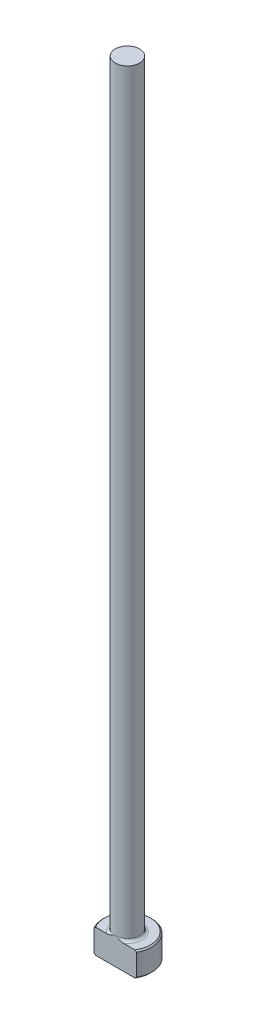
ISO-10303-21;
HEADER;
FILE_DESCRIPTION(('STEP AP214'),'2;1');
FILE_NAME('part.step','',(''),(''),'','','');
FILE_SCHEMA(('AUTOMOTIVE_DESIGN { 1 0 10303 214 1 1 1 1 }'));
ENDSEC;
DATA;
#1=APPLICATION_CONTEXT('core data for automotive mechanical design processes');
#2=APPLICATION_PROTOCOL_DEFINITION('international standard','automotive_design',2000,#1);
#3=PRODUCT_CONTEXT('',#1,'mechanical');
#4=PRODUCT('Part','Part','',(#3));
#5=PRODUCT_RELATED_PRODUCT_CATEGORY('part','',(#4));
#6=PRODUCT_DEFINITION_FORMATION('','',#4);
#7=PRODUCT_DEFINITION_CONTEXT('part definition',#1,'design');
#8=PRODUCT_DEFINITION('design','',#6,#7);
#9=PRODUCT_DEFINITION_SHAPE('','',#8);
#10=(LENGTH_UNIT() NAMED_UNIT(*) SI_UNIT(.MILLI.,.METRE.));
#11=(NAMED_UNIT(*) PLANE_ANGLE_UNIT() SI_UNIT($,.RADIAN.));
#12=(NAMED_UNIT(*) SI_UNIT($,.STERADIAN.) SOLID_ANGLE_UNIT());
#13=UNCERTAINTY_MEASURE_WITH_UNIT(LENGTH_MEASURE(1.E-05),#10,'distance_accuracy_value','');
#14=(GEOMETRIC_REPRESENTATION_CONTEXT(3) GLOBAL_UNCERTAINTY_ASSIGNED_CONTEXT((#13)) GLOBAL_UNIT_ASSIGNED_CONTEXT((#10,
#11,#12)) REPRESENTATION_CONTEXT('',''));
#15=CARTESIAN_POINT('',(0.,0.,0.));
#16=DIRECTION('',(0.,0.,1.));
#17=DIRECTION('',(1.,0.,0.));
#18=AXIS2_PLACEMENT_3D('',#15,#16,#17);
#19=CARTESIAN_POINT('',(0.,0.,0.));
#20=DIRECTION('',(0.,-1.,0.));
#21=DIRECTION('',(0.,0.,-1.));
#22=AXIS2_PLACEMENT_3D('',#19,#20,#21);
#23=PLANE('',#22);
#24=DIRECTION('',(1.,0.,0.));
#25=VECTOR('',#24,1.);
#26=CARTESIAN_POINT('',(-4.12444598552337,0.,2.38124999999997));
#27=LINE('',#26,#25);
#28=CARTESIAN_POINT('',(-3.82834437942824,0.,2.38124999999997));
#29=VERTEX_POINT('',#28);
#30=CARTESIAN_POINT('',(3.82834437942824,0.,2.38124999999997));
#31=VERTEX_POINT('',#30);
#32=EDGE_CURVE('E92',#29,#31,#27,.T.);
#33=ORIENTED_EDGE('',*,*,#32,.F.);
#34=CARTESIAN_POINT('',(0.,0.,0.));
#35=DIRECTION('',(0.,-1.,0.));
#36=DIRECTION('',(0.,0.,-1.));
#37=AXIS2_PLACEMENT_3D('',#34,#35,#36);
#38=CIRCLE('',#37,4.50849999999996);
#39=EDGE_CURVE('E105',#29,#31,#38,.T.);
#40=ORIENTED_EDGE('',*,*,#39,.T.);
#41=EDGE_LOOP('',(#33,#40));
#42=FACE_BOUND('',#41,.T.);
#43=ADVANCED_FACE('F37',(#42),#23,.T.);
#44=CARTESIAN_POINT('',(0.,259.958771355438,0.));
#45=DIRECTION('',(0.,1.,0.));
#46=DIRECTION('',(0.,0.,1.));
#47=AXIS2_PLACEMENT_3D('',#44,#45,#46);
#48=CYLINDRICAL_SURFACE('',#47,4.76249999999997);
#49=DIRECTION('',(0.,-1.,0.));
#50=VECTOR('',#49,1.);
#51=CARTESIAN_POINT('',(-4.12444598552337,152.4,2.38124999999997));
#52=LINE('',#51,#50);
#53=CARTESIAN_POINT('',(-4.12444598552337,4.49579999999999,2.38124999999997));
#54=VERTEX_POINT('',#53);
#55=CARTESIAN_POINT('',(-4.12444598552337,0.254000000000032,2.38124999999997));
#56=VERTEX_POINT('',#55);
#57=EDGE_CURVE('E95',#54,#56,#52,.T.);
#58=ORIENTED_EDGE('',*,*,#57,.F.);
#59=CARTESIAN_POINT('',(0.,4.49579999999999,0.));
#60=DIRECTION('',(0.,1.,0.));
#61=DIRECTION('',(0.,0.,1.));
#62=AXIS2_PLACEMENT_3D('',#59,#60,#61);
#63=CIRCLE('',#62,4.76249999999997);
#64=CARTESIAN_POINT('',(4.12444598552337,4.49579999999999,2.38124999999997));
#65=VERTEX_POINT('',#64);
#66=EDGE_CURVE('E109',#54,#65,#63,.F.);
#67=ORIENTED_EDGE('',*,*,#66,.T.);
#68=DIRECTION('',(0.,-1.,0.));
#69=VECTOR('',#68,1.);
#70=CARTESIAN_POINT('',(4.12444598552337,152.4,2.38124999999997));
#71=LINE('',#70,#69);
#72=CARTESIAN_POINT('',(4.12444598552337,0.254000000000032,2.38124999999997));
#73=VERTEX_POINT('',#72);
#74=EDGE_CURVE('E187',#65,#73,#71,.T.);
#75=ORIENTED_EDGE('',*,*,#74,.T.);
#76=CARTESIAN_POINT('',(0.,0.254000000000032,0.));
#77=DIRECTION('',(0.,-1.,0.));
#78=DIRECTION('',(0.,0.,-1.));
#79=AXIS2_PLACEMENT_3D('',#76,#77,#78);
#80=CIRCLE('',#79,4.76249999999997);
#81=EDGE_CURVE('E115',#73,#56,#80,.F.);
#82=ORIENTED_EDGE('',*,*,#81,.T.);
#83=EDGE_LOOP('',(#58,#67,#75,#82));
#84=FACE_BOUND('',#83,.T.);
#85=ADVANCED_FACE('F160',(#84),#48,.T.);
#86=CARTESIAN_POINT('',(-4.76249999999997,4.7498,0.));
#87=DIRECTION('',(0.,1.,0.));
#88=DIRECTION('',(0.,0.,1.));
#89=AXIS2_PLACEMENT_3D('',#86,#87,#88);
#90=PLANE('',#89);
#91=DIRECTION('',(-1.,0.,0.));
#92=VECTOR('',#91,1.);
#93=CARTESIAN_POINT('',(-4.76249999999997,4.7498,2.38124999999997));
#94=LINE('',#93,#92);
#95=CARTESIAN_POINT('',(3.82834437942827,4.7498,2.38124999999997));
#96=VERTEX_POINT('',#95);
#97=CARTESIAN_POINT('',(1.63628053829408,4.7498,2.38124999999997));
#98=VERTEX_POINT('',#97);
#99=EDGE_CURVE('E58',#96,#98,#94,.T.);
#100=ORIENTED_EDGE('',*,*,#99,.F.);
#101=CARTESIAN_POINT('',(0.,4.7498,0.));
#102=DIRECTION('',(0.,1.,0.));
#103=DIRECTION('',(0.,0.,1.));
#104=AXIS2_PLACEMENT_3D('',#101,#102,#103);
#105=CIRCLE('',#104,4.50849999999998);
#106=CARTESIAN_POINT('',(-3.82834437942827,4.7498,2.38124999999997));
#107=VERTEX_POINT('',#106);
#108=EDGE_CURVE('E182',#96,#107,#105,.T.);
#109=ORIENTED_EDGE('',*,*,#108,.T.);
#110=CARTESIAN_POINT('',(-1.63628053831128,4.74979999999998,2.38124999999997));
#111=VERTEX_POINT('',#110);
#112=EDGE_CURVE('E140',#111,#107,#94,.T.);
#113=ORIENTED_EDGE('',*,*,#112,.F.);
#114=CARTESIAN_POINT('',(0.,4.7498,0.));
#115=DIRECTION('',(0.,1.,0.));
#116=DIRECTION('',(0.,0.,1.));
#117=AXIS2_PLACEMENT_3D('',#114,#115,#116);
#118=CIRCLE('',#117,2.88924999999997);
#119=EDGE_CURVE('E112',#111,#98,#118,.F.);
#120=ORIENTED_EDGE('',*,*,#119,.T.);
#121=EDGE_LOOP('',(#100,#109,#113,#120));
#122=FACE_BOUND('',#121,.T.);
#123=ADVANCED_FACE('F164',(#122),#90,.T.);
#124=CARTESIAN_POINT('',(0.,259.958771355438,0.));
#125=DIRECTION('',(0.,1.,0.));
#126=DIRECTION('',(0.,0.,1.));
#127=AXIS2_PLACEMENT_3D('',#124,#125,#126);
#128=CYLINDRICAL_SURFACE('',#127,2.38124999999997);
#129=CARTESIAN_POINT('',(0.,5.25779999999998,0.));
#130=DIRECTION('',(0.,1.,0.));
#131=DIRECTION('',(0.,0.,1.));
#132=AXIS2_PLACEMENT_3D('',#129,#130,#131);
#133=CIRCLE('',#132,2.38124999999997);
#134=CARTESIAN_POINT('',(0.,5.25779999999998,2.38124999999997));
#135=VERTEX_POINT('',#134);
#136=EDGE_CURVE('E108',#135,#135,#133,.T.);
#137=ORIENTED_EDGE('',*,*,#136,.T.);
#138=EDGE_LOOP('',(#137));
#139=FACE_BOUND('',#138,.T.);
#140=CARTESIAN_POINT('',(0.,152.4,0.));
#141=DIRECTION('',(0.,1.,0.));
#142=DIRECTION('',(0.,0.,1.));
#143=AXIS2_PLACEMENT_3D('',#140,#141,#142);
#144=CIRCLE('',#143,2.38124999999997);
#145=CARTESIAN_POINT('',(0.,152.4,2.38124999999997));
#146=VERTEX_POINT('',#145);
#147=EDGE_CURVE('E100',#146,#146,#144,.T.);
#148=ORIENTED_EDGE('',*,*,#147,.F.);
#149=EDGE_LOOP('',(#148));
#150=FACE_BOUND('',#149,.T.);
#151=ADVANCED_FACE('F169',(#139,#150),#128,.T.);
#152=CARTESIAN_POINT('',(-2.38124999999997,152.4,0.));
#153=DIRECTION('',(0.,1.,0.));
#154=DIRECTION('',(0.,0.,1.));
#155=AXIS2_PLACEMENT_3D('',#152,#153,#154);
#156=PLANE('',#155);
#157=ORIENTED_EDGE('',*,*,#147,.T.);
#158=EDGE_LOOP('',(#157));
#159=FACE_BOUND('',#158,.T.);
#160=ADVANCED_FACE('F127',(#159),#156,.T.);
#161=CARTESIAN_POINT('',(0.,4.74980000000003,0.));
#162=DIRECTION('',(0.,-1.,0.));
#163=DIRECTION('',(0.,0.,-1.));
#164=AXIS2_PLACEMENT_3D('',#161,#162,#163);
#165=CONICAL_SURFACE('',#164,4.50849999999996,0.785398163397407);
#166=CARTESIAN_POINT('',(4.12514598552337,4.49519376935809,2.38124999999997));
#167=CARTESIAN_POINT('',(4.00297518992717,4.60095936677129,2.38124999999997));
#168=CARTESIAN_POINT('',(3.88025631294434,4.7061050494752,2.38124999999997));
#169=CARTESIAN_POINT('',(3.63329815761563,4.9147146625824,2.38124999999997));
#170=CARTESIAN_POINT('',(3.50905817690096,5.01817776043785,2.38124999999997));
#171=CARTESIAN_POINT('',(3.2558160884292,5.22527725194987,2.38124999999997));
#172=CARTESIAN_POINT('',(3.12677062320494,5.32886083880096,2.38124999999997));
#173=CARTESIAN_POINT('',(2.86622698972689,5.53284356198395,2.38124999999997));
#174=CARTESIAN_POINT('',(2.7347294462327,5.63324349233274,2.38124999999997));
#175=CARTESIAN_POINT('',(2.46828886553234,5.82978962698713,2.38124999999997));
#176=CARTESIAN_POINT('',(2.33334128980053,5.92592971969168,2.38124999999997));
#177=CARTESIAN_POINT('',(2.0589776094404,6.11194575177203,2.38124999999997));
#178=CARTESIAN_POINT('',(1.91955795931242,6.20181653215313,2.38124999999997));
#179=CARTESIAN_POINT('',(1.63609152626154,6.37137961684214,2.38124999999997));
#180=CARTESIAN_POINT('',(1.49209041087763,6.45114724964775,2.38124999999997));
#181=CARTESIAN_POINT('',(1.19698803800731,6.59621615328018,2.38124999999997));
#182=CARTESIAN_POINT('',(1.04590060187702,6.66154427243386,2.38124999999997));
#183=CARTESIAN_POINT('',(0.811614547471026,6.7436275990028,2.38124999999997));
#184=CARTESIAN_POINT('',(0.731281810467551,6.76852601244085,2.38124999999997));
#185=CARTESIAN_POINT('',(0.568750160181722,6.81132512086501,2.38124999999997));
#186=CARTESIAN_POINT('',(0.486551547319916,6.82922693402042,2.38124999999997));
#187=CARTESIAN_POINT('',(0.321272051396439,6.85684671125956,2.38124999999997));
#188=CARTESIAN_POINT('',(0.238199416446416,6.86661311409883,2.38124999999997));
#189=CARTESIAN_POINT('',(0.0714834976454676,6.87742889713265,2.38124999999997));
#190=CARTESIAN_POINT('',(-0.0121597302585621,6.8784791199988,2.38124999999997));
#191=CARTESIAN_POINT('',(-0.179163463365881,6.8717794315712,2.38124999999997));
#192=CARTESIAN_POINT('',(-0.262523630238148,6.86402127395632,2.38124999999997));
#193=CARTESIAN_POINT('',(-0.428053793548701,6.84027123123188,2.38124999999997));
#194=CARTESIAN_POINT('',(-0.510223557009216,6.82427775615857,2.38124999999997));
#195=CARTESIAN_POINT('',(-0.673363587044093,6.78495183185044,2.38124999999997));
#196=CARTESIAN_POINT('',(-0.754321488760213,6.76156896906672,2.38124999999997));
#197=CARTESIAN_POINT('',(-0.914191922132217,6.70871125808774,2.38124999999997));
#198=CARTESIAN_POINT('',(-0.993104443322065,6.67923637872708,2.38124999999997));
#199=CARTESIAN_POINT('',(-1.16723389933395,6.60781445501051,2.38124999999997));
#200=CARTESIAN_POINT('',(-1.26191225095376,6.56456501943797,2.38124999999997));
#201=CARTESIAN_POINT('',(-1.44844363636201,6.47230549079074,2.38124999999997));
#202=CARTESIAN_POINT('',(-1.54029498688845,6.4232920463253,2.38124999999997));
#203=CARTESIAN_POINT('',(-1.72169646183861,6.32078732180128,2.38124999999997));
#204=CARTESIAN_POINT('',(-1.81124138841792,6.26728691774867,2.38124999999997));
#205=CARTESIAN_POINT('',(-1.98819821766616,6.15692869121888,2.38124999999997));
#206=CARTESIAN_POINT('',(-2.07561054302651,6.10007154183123,2.38124999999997));
#207=CARTESIAN_POINT('',(-2.24912105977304,5.9834335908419,2.38124999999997));
#208=CARTESIAN_POINT('',(-2.33520994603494,5.92363901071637,2.38124999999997));
#209=CARTESIAN_POINT('',(-2.50589894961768,5.80195652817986,2.38124999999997));
#210=CARTESIAN_POINT('',(-2.59049895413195,5.74006846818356,2.38124999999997));
#211=CARTESIAN_POINT('',(-2.84223660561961,5.55206990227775,2.38124999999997));
#212=CARTESIAN_POINT('',(-3.00752130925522,5.42348112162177,2.38124999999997));
#213=CARTESIAN_POINT('',(-3.33377354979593,5.16258132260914,2.38124999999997));
#214=CARTESIAN_POINT('',(-3.49475818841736,5.03029147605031,2.38124999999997));
#215=CARTESIAN_POINT('',(-3.73348531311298,4.83027359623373,2.38124999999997));
#216=CARTESIAN_POINT('',(-3.81219356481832,4.76369334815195,2.38124999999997));
#217=CARTESIAN_POINT('',(-3.96906071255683,4.62989594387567,2.38124999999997));
#218=CARTESIAN_POINT('',(-4.04721963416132,4.56267881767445,2.38124999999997));
#219=CARTESIAN_POINT('',(-4.12514598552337,4.49519376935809,2.38124999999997));
#220=B_SPLINE_CURVE_WITH_KNOTS('',3,(#166,#167,#168,#169,#170,#171,#172,#173,#174,#175,#176,
#177,#178,#179,#180,#181,#182,#183,#184,#185,#186,#187,#188,#189,#190,#191,#192,#193,#194,#195,
#196,#197,#198,#199,#200,#201,#202,#203,#204,#205,#206,#207,#208,#209,#210,#211,#212,#213,#214,
#215,#216,#217,#218,#219),.UNSPECIFIED.,.F.,.F.,(4,2,2,2,2,2,2,2,2,2,2,2,2,2,2,2,2,2,2,2,2,2,2,
2,2,2,4),(0.,0.484787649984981,0.969808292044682,1.46620017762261,1.96246727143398,
2.45942471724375,2.95678639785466,3.45018895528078,3.94266623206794,4.19472143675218,
4.44673634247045,4.69723978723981,4.94771901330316,5.19843292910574,5.4491952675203,
5.70170675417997,5.95421953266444,6.26622041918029,6.57840361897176,6.89123777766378,
7.20400941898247,7.51842263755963,7.83285957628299,8.46097181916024,9.08602581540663,
9.39529830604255,9.70455630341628),.UNSPECIFIED.);
#221=EDGE_CURVE('E63',#65,#96,#220,.T.);
#222=ORIENTED_EDGE('',*,*,#221,.F.);
#223=ORIENTED_EDGE('',*,*,#66,.F.);
#224=EDGE_CURVE('E133',#107,#54,#220,.T.);
#225=ORIENTED_EDGE('',*,*,#224,.F.);
#226=ORIENTED_EDGE('',*,*,#108,.F.);
#227=EDGE_LOOP('',(#222,#223,#225,#226));
#228=FACE_BOUND('',#227,.T.);
#229=ADVANCED_FACE('F147',(#228),#165,.T.);
#230=CARTESIAN_POINT('',(0.,0.254000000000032,0.));
#231=DIRECTION('',(0.,1.,0.));
#232=DIRECTION('',(0.,0.,1.));
#233=AXIS2_PLACEMENT_3D('',#230,#231,#232);
#234=CONICAL_SURFACE('',#233,4.76249999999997,0.785398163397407);
#235=CARTESIAN_POINT('',(-4.12514598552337,0.254606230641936,2.38124999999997));
#236=CARTESIAN_POINT('',(-4.00297518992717,0.148840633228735,2.38124999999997));
#237=CARTESIAN_POINT('',(-3.88025631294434,0.0436949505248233,2.38124999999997));
#238=CARTESIAN_POINT('',(-3.63329815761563,-0.164914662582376,2.38124999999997));
#239=CARTESIAN_POINT('',(-3.50905817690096,-0.268377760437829,2.38124999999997));
#240=CARTESIAN_POINT('',(-3.2558160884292,-0.475477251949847,2.38124999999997));
#241=CARTESIAN_POINT('',(-3.12677062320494,-0.579060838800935,2.38124999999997));
#242=CARTESIAN_POINT('',(-2.86622698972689,-0.783043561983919,2.38124999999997));
#243=CARTESIAN_POINT('',(-2.7347294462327,-0.88344349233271,2.38124999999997));
#244=CARTESIAN_POINT('',(-2.46828886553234,-1.0799896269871,2.38124999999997));
#245=CARTESIAN_POINT('',(-2.33334128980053,-1.17612971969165,2.38124999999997));
#246=CARTESIAN_POINT('',(-2.0589776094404,-1.362145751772,2.38124999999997));
#247=CARTESIAN_POINT('',(-1.91955795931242,-1.4520165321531,2.38124999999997));
#248=CARTESIAN_POINT('',(-1.63609152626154,-1.62157961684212,2.38124999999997));
#249=CARTESIAN_POINT('',(-1.49209041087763,-1.70134724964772,2.38124999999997));
#250=CARTESIAN_POINT('',(-1.1969880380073,-1.84641615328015,2.38124999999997));
#251=CARTESIAN_POINT('',(-1.04590060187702,-1.91174427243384,2.38124999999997));
#252=CARTESIAN_POINT('',(-0.811614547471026,-1.99382759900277,2.38124999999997));
#253=CARTESIAN_POINT('',(-0.731281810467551,-2.01872601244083,2.38124999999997));
#254=CARTESIAN_POINT('',(-0.568750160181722,-2.06152512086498,2.38124999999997));
#255=CARTESIAN_POINT('',(-0.486551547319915,-2.0794269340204,2.38124999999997));
#256=CARTESIAN_POINT('',(-0.321272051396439,-2.10704671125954,2.38124999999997));
#257=CARTESIAN_POINT('',(-0.238199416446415,-2.11681311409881,2.38124999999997));
#258=CARTESIAN_POINT('',(-0.0714834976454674,-2.12762889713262,2.38124999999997));
#259=CARTESIAN_POINT('',(0.012159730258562,-2.12867911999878,2.38124999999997));
#260=CARTESIAN_POINT('',(0.17916346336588,-2.12197943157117,2.38124999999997));
#261=CARTESIAN_POINT('',(0.262523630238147,-2.1142212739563,2.38124999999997));
#262=CARTESIAN_POINT('',(0.4280537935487,-2.09047123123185,2.38124999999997));
#263=CARTESIAN_POINT('',(0.510223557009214,-2.07447775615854,2.38124999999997));
#264=CARTESIAN_POINT('',(0.673363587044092,-2.03515183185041,2.38124999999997));
#265=CARTESIAN_POINT('',(0.754321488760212,-2.01176896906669,2.38124999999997));
#266=CARTESIAN_POINT('',(0.914191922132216,-1.95891125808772,2.38124999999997));
#267=CARTESIAN_POINT('',(0.993104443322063,-1.92943637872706,2.38124999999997));
#268=CARTESIAN_POINT('',(1.16723389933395,-1.85801445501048,2.38124999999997));
#269=CARTESIAN_POINT('',(1.26191225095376,-1.81476501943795,2.38124999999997));
#270=CARTESIAN_POINT('',(1.44844363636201,-1.72250549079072,2.38124999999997));
#271=CARTESIAN_POINT('',(1.54029498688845,-1.67349204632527,2.38124999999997));
#272=CARTESIAN_POINT('',(1.72169646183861,-1.57098732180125,2.38124999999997));
#273=CARTESIAN_POINT('',(1.81124138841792,-1.51748691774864,2.38124999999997));
#274=CARTESIAN_POINT('',(1.98819821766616,-1.40712869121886,2.38124999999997));
#275=CARTESIAN_POINT('',(2.0756105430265,-1.3502715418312,2.38124999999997));
#276=CARTESIAN_POINT('',(2.24912105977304,-1.23363359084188,2.38124999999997));
#277=CARTESIAN_POINT('',(2.33520994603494,-1.17383901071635,2.38124999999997));
#278=CARTESIAN_POINT('',(2.50589894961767,-1.05215652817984,2.38124999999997));
#279=CARTESIAN_POINT('',(2.59049895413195,-0.990268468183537,2.38124999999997));
#280=CARTESIAN_POINT('',(2.84223660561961,-0.80226990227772,2.38124999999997));
#281=CARTESIAN_POINT('',(3.00752130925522,-0.673681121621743,2.38124999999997));
#282=CARTESIAN_POINT('',(3.33377354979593,-0.412781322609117,2.38124999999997));
#283=CARTESIAN_POINT('',(3.49475818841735,-0.280491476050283,2.38124999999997));
#284=CARTESIAN_POINT('',(3.73348531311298,-0.0804735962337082,2.38124999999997));
#285=CARTESIAN_POINT('',(3.81219356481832,-0.0138933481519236,2.38124999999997));
#286=CARTESIAN_POINT('',(3.96906071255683,0.119904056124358,2.38124999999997));
#287=CARTESIAN_POINT('',(4.04721963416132,0.187121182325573,2.38124999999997));
#288=CARTESIAN_POINT('',(4.12514598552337,0.254606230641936,2.38124999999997));
#289=B_SPLINE_CURVE_WITH_KNOTS('',3,(#235,#236,#237,#238,#239,#240,#241,#242,#243,#244,#245,
#246,#247,#248,#249,#250,#251,#252,#253,#254,#255,#256,#257,#258,#259,#260,#261,#262,#263,#264,
#265,#266,#267,#268,#269,#270,#271,#272,#273,#274,#275,#276,#277,#278,#279,#280,#281,#282,#283,
#284,#285,#286,#287,#288),.UNSPECIFIED.,.F.,.F.,(4,2,2,2,2,2,2,2,2,2,2,2,2,2,2,2,2,2,2,2,2,2,2,
2,2,2,4),(0.,0.484787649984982,0.969808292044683,1.46620017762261,1.96246727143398,
2.45942471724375,2.95678639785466,3.45018895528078,3.94266623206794,4.19472143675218,
4.44673634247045,4.69723978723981,4.94771901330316,5.19843292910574,5.4491952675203,
5.70170675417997,5.95421953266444,6.26622041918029,6.57840361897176,6.89123777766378,
7.20400941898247,7.51842263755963,7.83285957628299,8.46097181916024,9.08602581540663,
9.39529830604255,9.70455630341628),.UNSPECIFIED.);
#290=EDGE_CURVE('E89',#56,#29,#289,.T.);
#291=ORIENTED_EDGE('',*,*,#290,.F.);
#292=ORIENTED_EDGE('',*,*,#81,.F.);
#293=EDGE_CURVE('E101',#31,#73,#289,.T.);
#294=ORIENTED_EDGE('',*,*,#293,.F.);
#295=ORIENTED_EDGE('',*,*,#39,.F.);
#296=EDGE_LOOP('',(#291,#292,#294,#295));
#297=FACE_BOUND('',#296,.T.);
#298=ADVANCED_FACE('F107',(#297),#234,.T.);
#299=CARTESIAN_POINT('',(0.,5.25779999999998,0.));
#300=DIRECTION('',(0.,1.,0.));
#301=DIRECTION('',(0.,0.,1.));
#302=AXIS2_PLACEMENT_3D('',#299,#300,#301);
#303=TOROIDAL_SURFACE('',#302,2.88924999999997,0.508);
#304=ORIENTED_EDGE('',*,*,#119,.F.);
#305=CARTESIAN_POINT('',(0.,5.25779999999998,2.38124999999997));
#306=CARTESIAN_POINT('',(0.,5.25780082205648,2.38124999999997));
#307=CARTESIAN_POINT('',(-1.44246314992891E-07,5.25780164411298,2.38124999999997));
#308=CARTESIAN_POINT('',(-6.16936499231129E-07,5.25780323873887,2.38124999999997));
#309=CARTESIAN_POINT('',(-9.48586305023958E-07,5.25780401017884,2.38124999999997));
#310=CARTESIAN_POINT('',(-1.75082077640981E-06,5.25780554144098,2.38124999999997));
#311=CARTESIAN_POINT('',(-2.22915455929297E-06,5.25780629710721,2.38124999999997));
#312=CARTESIAN_POINT('',(-3.2718145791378E-06,5.25780773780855,2.38124999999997));
#313=CARTESIAN_POINT('',(-3.83567667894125E-06,5.25780842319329,2.38124999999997));
#314=CARTESIAN_POINT('',(-5.82219730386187E-06,5.25781066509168,2.38124999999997));
#315=CARTESIAN_POINT('',(-7.35849849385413E-06,5.25781212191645,2.38124999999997));
#316=CARTESIAN_POINT('',(-1.05702998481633E-05,5.25781476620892,2.38124999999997));
#317=CARTESIAN_POINT('',(-1.224110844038E-05,5.25781595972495,2.38124999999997));
#318=CARTESIAN_POINT('',(-1.86111247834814E-05,5.25782030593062,2.38124999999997));
#319=CARTESIAN_POINT('',(-2.34784761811E-05,5.25782322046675,2.38124999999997));
#320=CARTESIAN_POINT('',(-3.31956636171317E-05,5.25782811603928,2.38124999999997));
#321=CARTESIAN_POINT('',(-3.80196285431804E-05,5.25783015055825,2.38124999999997));
#322=CARTESIAN_POINT('',(-5.81326125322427E-05,5.25783854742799,2.38124999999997));
#323=CARTESIAN_POINT('',(-7.34799231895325E-05,5.25784474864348,2.38124999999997));
#324=CARTESIAN_POINT('',(-0.000102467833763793,5.25785494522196,2.38124999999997));
#325=CARTESIAN_POINT('',(-0.0001160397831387,5.25785912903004,2.38124999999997));
#326=CARTESIAN_POINT('',(-0.000212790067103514,5.25789158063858,2.38124999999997));
#327=CARTESIAN_POINT('',(-0.000291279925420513,5.25793204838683,2.38124999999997));
#328=CARTESIAN_POINT('',(-0.000593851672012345,5.25808218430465,2.38124999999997));
#329=CARTESIAN_POINT('',(-0.000821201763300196,5.25818279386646,2.38124999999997));
#330=CARTESIAN_POINT('',(-0.00169456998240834,5.25857522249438,2.38124999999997));
#331=CARTESIAN_POINT('',(-0.002337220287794,5.2588765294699,2.38124999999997));
#332=CARTESIAN_POINT('',(-0.00493753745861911,5.26008964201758,2.38124999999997));
#333=CARTESIAN_POINT('',(-0.00689891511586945,5.26099082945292,2.38124999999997));
#334=CARTESIAN_POINT('',(-0.0508383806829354,5.28118708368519,2.38124999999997));
#335=CARTESIAN_POINT('',(-0.0927708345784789,5.30061501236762,2.38124999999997));
#336=CARTESIAN_POINT('',(-0.175274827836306,5.3385104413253,2.38124999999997));
#337=CARTESIAN_POINT('',(-0.215842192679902,5.35698764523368,2.38124999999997));
#338=CARTESIAN_POINT('',(-0.301665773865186,5.39563561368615,2.38124999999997));
#339=CARTESIAN_POINT('',(-0.346940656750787,5.41576561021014,2.38124999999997));
#340=CARTESIAN_POINT('',(-0.438241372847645,5.45551278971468,2.38124999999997));
#341=CARTESIAN_POINT('',(-0.4842702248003,5.47512306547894,2.38124999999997));
#342=CARTESIAN_POINT('',(-0.565317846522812,5.50863652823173,2.38124999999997));
#343=CARTESIAN_POINT('',(-0.600248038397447,5.52275299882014,2.38124999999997));
#344=CARTESIAN_POINT('',(-0.670295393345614,5.55026700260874,2.38124999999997));
#345=CARTESIAN_POINT('',(-0.70541192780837,5.56366614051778,2.38124999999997));
#346=CARTESIAN_POINT('',(-0.809765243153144,5.60210810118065,2.38124999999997));
#347=CARTESIAN_POINT('',(-0.879437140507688,5.6259984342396,2.38124999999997));
#348=CARTESIAN_POINT('',(-0.996836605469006,5.66231043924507,2.38124999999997));
#349=CARTESIAN_POINT('',(-1.04419582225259,5.67591104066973,2.38124999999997));
#350=CARTESIAN_POINT('',(-1.13975994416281,5.70085221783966,2.38124999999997));
#351=CARTESIAN_POINT('',(-1.18796799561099,5.71218047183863,2.38124999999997));
#352=CARTESIAN_POINT('',(-1.33841293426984,5.74296860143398,2.38124999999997));
#353=CARTESIAN_POINT('',(-1.44177435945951,5.75767400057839,2.38124999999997));
#354=CARTESIAN_POINT('',(-1.60936912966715,5.76674980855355,2.38124999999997));
#355=CARTESIAN_POINT('',(-1.67328580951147,5.76678281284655,2.38124999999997));
#356=CARTESIAN_POINT('',(-1.79988036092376,5.75818170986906,2.38124999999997));
#357=CARTESIAN_POINT('',(-1.86256375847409,5.7496552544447,2.38124999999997));
#358=CARTESIAN_POINT('',(-1.9663105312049,5.72616398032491,2.38124999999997));
#359=CARTESIAN_POINT('',(-2.00801024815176,5.71404279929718,2.38124999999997));
#360=CARTESIAN_POINT('',(-2.08929854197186,5.6837572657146,2.38124999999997));
#361=CARTESIAN_POINT('',(-2.12888534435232,5.66558792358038,2.38124999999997));
#362=CARTESIAN_POINT('',(-2.19343451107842,5.62845715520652,2.38124999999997));
#363=CARTESIAN_POINT('',(-2.21936120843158,5.61118061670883,2.38124999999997));
#364=CARTESIAN_POINT('',(-2.26821976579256,5.57281353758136,2.38124999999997));
#365=CARTESIAN_POINT('',(-2.29115716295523,5.55173022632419,2.38124999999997));
#366=CARTESIAN_POINT('',(-2.3283351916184,5.51065246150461,2.38124999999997));
#367=CARTESIAN_POINT('',(-2.34338589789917,5.49139467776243,2.38124999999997));
#368=CARTESIAN_POINT('',(-2.37015797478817,5.45066634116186,2.38124999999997));
#369=CARTESIAN_POINT('',(-2.38188059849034,5.42919662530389,2.38124999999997));
#370=CARTESIAN_POINT('',(-2.40133155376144,5.38427591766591,2.38124999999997));
#371=CARTESIAN_POINT('',(-2.40902526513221,5.3608097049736,2.38124999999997));
#372=CARTESIAN_POINT('',(-2.4196333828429,5.31282025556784,2.38124999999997));
#373=CARTESIAN_POINT('',(-2.42255209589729,5.2882979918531,2.38124999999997));
#374=CARTESIAN_POINT('',(-2.42330579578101,5.24257134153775,2.38124999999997));
#375=CARTESIAN_POINT('',(-2.42178572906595,5.22137526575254,2.38124999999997));
#376=CARTESIAN_POINT('',(-2.41512107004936,5.17956667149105,2.38124999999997));
#377=CARTESIAN_POINT('',(-2.40997679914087,5.15895410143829,2.38124999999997));
#378=CARTESIAN_POINT('',(-2.39653123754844,5.11927433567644,2.38124999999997));
#379=CARTESIAN_POINT('',(-2.38829719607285,5.10018404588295,2.38124999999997));
#380=CARTESIAN_POINT('',(-2.36909923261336,5.06344104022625,2.38124999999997));
#381=CARTESIAN_POINT('',(-2.35813436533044,5.04578882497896,2.38124999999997));
#382=CARTESIAN_POINT('',(-2.3290070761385,5.00527867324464,2.38124999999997));
#383=CARTESIAN_POINT('',(-2.30973049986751,4.98322039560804,2.38124999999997));
#384=CARTESIAN_POINT('',(-2.26785259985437,4.94251014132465,2.38124999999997));
#385=CARTESIAN_POINT('',(-2.24524341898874,4.92386645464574,2.38124999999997));
#386=CARTESIAN_POINT('',(-2.18797490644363,4.88297636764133,2.38124999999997));
#387=CARTESIAN_POINT('',(-2.15215873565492,4.86235631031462,2.38124999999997));
#388=CARTESIAN_POINT('',(-2.07784819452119,4.82703601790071,2.38124999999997));
#389=CARTESIAN_POINT('',(-2.03935503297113,4.812333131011,2.38124999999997));
#390=CARTESIAN_POINT('',(-1.9391704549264,4.78128020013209,2.38124999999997));
#391=CARTESIAN_POINT('',(-1.87638619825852,4.76848853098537,2.38124999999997));
#392=CARTESIAN_POINT('',(-1.74894813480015,4.75239141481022,2.38124999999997));
#393=CARTESIAN_POINT('',(-1.68428057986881,4.74921386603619,2.38124999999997));
#394=CARTESIAN_POINT('',(-1.56080715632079,4.75049930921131,2.38124999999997));
#395=CARTESIAN_POINT('',(-1.50198901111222,4.75431101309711,2.38124999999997));
#396=CARTESIAN_POINT('',(-1.38480921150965,4.76709949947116,2.38124999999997));
#397=CARTESIAN_POINT('',(-1.32644892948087,4.77608822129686,2.38124999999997));
#398=CARTESIAN_POINT('',(-1.2135035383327,4.79766265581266,2.38124999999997));
#399=CARTESIAN_POINT('',(-1.15887777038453,4.81004137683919,2.38124999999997));
#400=CARTESIAN_POINT('',(-1.05073291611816,4.83776073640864,2.38124999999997));
#401=CARTESIAN_POINT('',(-0.997209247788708,4.85308377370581,2.38124999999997));
#402=CARTESIAN_POINT('',(-0.874272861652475,4.89132980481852,2.38124999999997));
#403=CARTESIAN_POINT('',(-0.805134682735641,4.91512993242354,2.38124999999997));
#404=CARTESIAN_POINT('',(-0.70156072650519,4.95339027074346,2.38124999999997));
#405=CARTESIAN_POINT('',(-0.666697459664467,4.96672252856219,2.38124999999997));
#406=CARTESIAN_POINT('',(-0.597152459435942,4.99408908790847,2.38124999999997));
#407=CARTESIAN_POINT('',(-0.562471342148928,5.00812495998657,2.38124999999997));
#408=CARTESIAN_POINT('',(-0.481905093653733,5.04147709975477,2.38124999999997));
#409=CARTESIAN_POINT('',(-0.436107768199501,5.06100454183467,2.38124999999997));
#410=CARTESIAN_POINT('',(-0.34526321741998,5.10057637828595,2.38124999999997));
#411=CARTESIAN_POINT('',(-0.300213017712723,5.12061397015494,2.38124999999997));
#412=CARTESIAN_POINT('',(-0.214815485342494,5.15907936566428,2.38124999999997));
#413=CARTESIAN_POINT('',(-0.174449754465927,5.17746700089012,2.38124999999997));
#414=CARTESIAN_POINT('',(-0.0923551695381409,5.21517676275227,2.38124999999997));
#415=CARTESIAN_POINT('',(-0.0506304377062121,5.23450847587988,2.38124999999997));
#416=CARTESIAN_POINT('',(-0.0068989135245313,5.25460917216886,2.38124999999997));
#417=CARTESIAN_POINT('',(-0.00493753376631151,5.25551035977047,2.38124999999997));
#418=CARTESIAN_POINT('',(-0.00233721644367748,5.25672347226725,2.38124999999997));
#419=CARTESIAN_POINT('',(-0.00169456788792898,5.25702477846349,2.38124999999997));
#420=CARTESIAN_POINT('',(-0.000821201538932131,5.25741720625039,2.38124999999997));
#421=CARTESIAN_POINT('',(-0.000593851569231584,5.25751781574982,2.38124999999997));
#422=CARTESIAN_POINT('',(-0.000291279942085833,5.25766795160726,2.38124999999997));
#423=CARTESIAN_POINT('',(-0.000212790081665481,5.25770841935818,2.38124999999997));
#424=CARTESIAN_POINT('',(-0.000116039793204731,5.25774087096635,2.38124999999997));
#425=CARTESIAN_POINT('',(-0.00010246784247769,5.25774505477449,2.38124999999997));
#426=CARTESIAN_POINT('',(-7.34799288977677E-05,5.25775525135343,2.38124999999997));
#427=CARTESIAN_POINT('',(-5.81326166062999E-05,5.25776145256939,2.38124999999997));
#428=CARTESIAN_POINT('',(-3.80196306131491E-05,5.25776984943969,2.38124999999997));
#429=CARTESIAN_POINT('',(-3.31956653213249E-05,5.25777188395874,2.38124999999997));
#430=CARTESIAN_POINT('',(-2.34784771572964E-05,5.25777677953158,2.38124999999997));
#431=CARTESIAN_POINT('',(-1.86111254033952E-05,5.25777969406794,2.38124999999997));
#432=CARTESIAN_POINT('',(-1.22411086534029E-05,5.25778404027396,2.38124999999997));
#433=CARTESIAN_POINT('',(-1.05702999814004E-05,5.25778523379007,2.38124999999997));
#434=CARTESIAN_POINT('',(-7.35849848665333E-06,5.25778787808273,2.38124999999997));
#435=CARTESIAN_POINT('',(-5.82219723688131E-06,5.25778933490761,2.38124999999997));
#436=CARTESIAN_POINT('',(-3.83567655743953E-06,5.25779157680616,2.38124999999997));
#437=CARTESIAN_POINT('',(-3.27181444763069E-06,5.25779226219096,2.38124999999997));
#438=CARTESIAN_POINT('',(-2.22915441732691E-06,5.25779370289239,2.38124999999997));
#439=CARTESIAN_POINT('',(-1.75082063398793E-06,5.25779445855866,2.38124999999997));
#440=CARTESIAN_POINT('',(-9.48586176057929E-07,5.25779598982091,2.38124999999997));
#441=CARTESIAN_POINT('',(-6.16936383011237E-07,5.25779676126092,2.38124999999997));
#442=CARTESIAN_POINT('',(-1.44246242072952E-07,5.2577983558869,2.38124999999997));
#443=CARTESIAN_POINT('',(0.,5.25779917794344,2.38124999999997));
#444=CARTESIAN_POINT('',(0.,5.25779999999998,2.38124999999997));
#445=B_SPLINE_CURVE_WITH_KNOTS('',3,(#305,#306,#307,#308,#309,#310,#311,#312,#313,#314,#315,
#316,#317,#318,#319,#320,#321,#322,#323,#324,#325,#326,#327,#328,#329,#330,#331,#332,#333,#334,
#335,#336,#337,#338,#339,#340,#341,#342,#343,#344,#345,#346,#347,#348,#349,#350,#351,#352,#353,
#354,#355,#356,#357,#358,#359,#360,#361,#362,#363,#364,#365,#366,#367,#368,#369,#370,#371,#372,
#373,#374,#375,#376,#377,#378,#379,#380,#381,#382,#383,#384,#385,#386,#387,#388,#389,#390,#391,
#392,#393,#394,#395,#396,#397,#398,#399,#400,#401,#402,#403,#404,#405,#406,#407,#408,#409,#410,
#411,#412,#413,#414,#415,#416,#417,#418,#419,#420,#421,#422,#423,#424,#425,#426,#427,#428,#429,
#430,#431,#432,#433,#434,#435,#436,#437,#438,#439,#440,#441,#442,#443,#444),.UNSPECIFIED.,.T.,
.F.,(4,2,2,2,2,2,2,2,2,2,2,2,2,2,2,2,2,2,2,2,2,2,2,2,2,2,2,2,2,2,2,2,2,2,2,2,2,2,2,2,2,2,2,2,2,
2,2,2,2,2,2,2,2,2,2,2,2,2,2,2,2,2,2,2,2,2,2,2,2,4),(0.,2.46370365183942E-06,
4.97088842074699E-06,7.64418248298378E-06,1.03034566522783E-05,1.66236497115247E-05,
2.27785420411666E-05,3.97364956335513E-05,5.54272301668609E-05,0.000105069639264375,
0.000147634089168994,0.000411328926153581,0.00115816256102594,0.00328628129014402,
0.00976302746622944,0.148387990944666,0.282122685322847,0.430762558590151,0.58085063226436,
0.693868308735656,0.806621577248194,1.02747193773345,1.1752336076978,1.32377605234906,
1.63564503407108,1.82698196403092,2.01594223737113,2.14586868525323,2.27590258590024,
2.36907162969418,2.46206556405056,2.53511017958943,2.60812725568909,2.68176187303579,
2.75533004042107,2.81876340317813,2.88219114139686,2.94431167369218,3.00645373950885,
3.09384902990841,3.18145376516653,3.30474645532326,3.42798382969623,3.61914317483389,
3.81283460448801,3.98938468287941,4.16634356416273,4.33427105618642,4.50122426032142,
4.72047312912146,4.83244543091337,4.9446798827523,5.09403179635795,5.24194322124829,
5.37501604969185,5.51295433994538,5.51943109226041,5.52155920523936,5.52230603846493,
5.52256973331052,5.52261229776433,5.52266194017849,5.52267763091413,5.52269458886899,
5.52270074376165,5.52270706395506,5.52270972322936,5.52271239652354,5.52271490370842,
5.52271736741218),.UNSPECIFIED.);
#446=EDGE_CURVE('E11',#111,#135,#445,.T.);
#447=ORIENTED_EDGE('',*,*,#446,.T.);
#448=ORIENTED_EDGE('',*,*,#136,.F.);
#449=CARTESIAN_POINT('',(0.,5.25779999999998,2.38124999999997));
#450=CARTESIAN_POINT('',(0.,5.25779917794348,2.38124999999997));
#451=CARTESIAN_POINT('',(1.44246314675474E-07,5.25779835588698,2.38124999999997));
#452=CARTESIAN_POINT('',(6.16936499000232E-07,5.25779676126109,2.38124999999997));
#453=CARTESIAN_POINT('',(9.48586304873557E-07,5.25779598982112,2.38124999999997));
#454=CARTESIAN_POINT('',(1.75082077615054E-06,5.25779445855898,2.38124999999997));
#455=CARTESIAN_POINT('',(2.22915455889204E-06,5.25779370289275,2.38124999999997));
#456=CARTESIAN_POINT('',(3.27181457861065E-06,5.25779226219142,2.38124999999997));
#457=CARTESIAN_POINT('',(3.83567667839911E-06,5.25779157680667,2.38124999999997));
#458=CARTESIAN_POINT('',(5.82219730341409E-06,5.25778933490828,2.38124999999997));
#459=CARTESIAN_POINT('',(7.35849849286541E-06,5.25778787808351,2.38124999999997));
#460=CARTESIAN_POINT('',(1.05702998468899E-05,5.25778523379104,2.38124999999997));
#461=CARTESIAN_POINT('',(1.2241108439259E-05,5.25778404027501,2.38124999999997));
#462=CARTESIAN_POINT('',(1.86111247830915E-05,5.25777969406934,2.38124999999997));
#463=CARTESIAN_POINT('',(2.34784761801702E-05,5.25777677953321,2.38124999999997));
#464=CARTESIAN_POINT('',(3.31956636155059E-05,5.25777188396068,2.38124999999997));
#465=CARTESIAN_POINT('',(3.8019628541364E-05,5.25776984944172,2.38124999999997));
#466=CARTESIAN_POINT('',(5.81326125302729E-05,5.25776145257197,2.38124999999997));
#467=CARTESIAN_POINT('',(7.34799231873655E-05,5.25775525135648,2.38124999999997));
#468=CARTESIAN_POINT('',(0.000102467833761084,5.257745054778,2.38124999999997));
#469=CARTESIAN_POINT('',(0.000116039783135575,5.25774087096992,2.38124999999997));
#470=CARTESIAN_POINT('',(0.00021279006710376,5.25770841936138,2.38124999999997));
#471=CARTESIAN_POINT('',(0.000291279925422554,5.25766795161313,2.38124999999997));
#472=CARTESIAN_POINT('',(0.000593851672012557,5.2575178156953,2.38124999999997));
#473=CARTESIAN_POINT('',(0.000821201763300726,5.25741720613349,2.38124999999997));
#474=CARTESIAN_POINT('',(0.00169456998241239,5.25702477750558,2.38124999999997));
#475=CARTESIAN_POINT('',(0.00233722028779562,5.25672347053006,2.38124999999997));
#476=CARTESIAN_POINT('',(0.00493753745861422,5.25551035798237,2.38124999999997));
#477=CARTESIAN_POINT('',(0.00689891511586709,5.25460917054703,2.38124999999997));
#478=CARTESIAN_POINT('',(0.0508383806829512,5.23441291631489,2.38124999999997));
#479=CARTESIAN_POINT('',(0.092770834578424,5.21498498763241,2.38124999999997));
#480=CARTESIAN_POINT('',(0.175274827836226,5.17708955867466,2.38124999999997));
#481=CARTESIAN_POINT('',(0.215842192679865,5.15861235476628,2.38124999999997));
#482=CARTESIAN_POINT('',(0.301665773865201,5.11996438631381,2.38124999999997));
#483=CARTESIAN_POINT('',(0.346940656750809,5.09983438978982,2.38124999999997));
#484=CARTESIAN_POINT('',(0.438241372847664,5.06008721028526,2.38124999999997));
#485=CARTESIAN_POINT('',(0.48427022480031,5.04047693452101,2.38124999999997));
#486=CARTESIAN_POINT('',(0.565317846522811,5.00696347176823,2.38124999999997));
#487=CARTESIAN_POINT('',(0.600248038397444,4.99284700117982,2.38124999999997));
#488=CARTESIAN_POINT('',(0.670295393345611,4.96533299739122,2.38124999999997));
#489=CARTESIAN_POINT('',(0.705411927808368,4.95193385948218,2.38124999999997));
#490=CARTESIAN_POINT('',(0.809765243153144,4.91349189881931,2.38124999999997));
#491=CARTESIAN_POINT('',(0.879437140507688,4.88960156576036,2.38124999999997));
#492=CARTESIAN_POINT('',(0.996836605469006,4.85328956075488,2.38124999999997));
#493=CARTESIAN_POINT('',(1.04419582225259,4.83968895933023,2.38124999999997));
#494=CARTESIAN_POINT('',(1.13975994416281,4.8147477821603,2.38124999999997));
#495=CARTESIAN_POINT('',(1.18796799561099,4.80341952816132,2.38124999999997));
#496=CARTESIAN_POINT('',(1.33841293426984,4.77263139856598,2.38124999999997));
#497=CARTESIAN_POINT('',(1.44177435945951,4.75792599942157,2.38124999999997));
#498=CARTESIAN_POINT('',(1.60936912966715,4.74885019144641,2.38124999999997));
#499=CARTESIAN_POINT('',(1.67328580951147,4.74881718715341,2.38124999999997));
#500=CARTESIAN_POINT('',(1.79988036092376,4.7574182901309,2.38124999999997));
#501=CARTESIAN_POINT('',(1.86256375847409,4.76594474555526,2.38124999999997));
#502=CARTESIAN_POINT('',(1.9663105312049,4.78943601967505,2.38124999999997));
#503=CARTESIAN_POINT('',(2.00801024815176,4.80155720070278,2.38124999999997));
#504=CARTESIAN_POINT('',(2.08929854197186,4.83184273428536,2.38124999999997));
#505=CARTESIAN_POINT('',(2.12888534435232,4.85001207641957,2.38124999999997));
#506=CARTESIAN_POINT('',(2.19343451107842,4.88714284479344,2.38124999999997));
#507=CARTESIAN_POINT('',(2.21936120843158,4.90441938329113,2.38124999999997));
#508=CARTESIAN_POINT('',(2.26821976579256,4.9427864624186,2.38124999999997));
#509=CARTESIAN_POINT('',(2.29115716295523,4.96386977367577,2.38124999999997));
#510=CARTESIAN_POINT('',(2.3283351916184,5.00494753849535,2.38124999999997));
#511=CARTESIAN_POINT('',(2.34338589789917,5.02420532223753,2.38124999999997));
#512=CARTESIAN_POINT('',(2.37015797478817,5.0649336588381,2.38124999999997));
#513=CARTESIAN_POINT('',(2.38188059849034,5.08640337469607,2.38124999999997));
#514=CARTESIAN_POINT('',(2.40133155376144,5.13132408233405,2.38124999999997));
#515=CARTESIAN_POINT('',(2.40902526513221,5.15479029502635,2.38124999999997));
#516=CARTESIAN_POINT('',(2.4196333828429,5.20277974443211,2.38124999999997));
#517=CARTESIAN_POINT('',(2.42255209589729,5.22730200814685,2.38124999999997));
#518=CARTESIAN_POINT('',(2.42330579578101,5.27302865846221,2.38124999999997));
#519=CARTESIAN_POINT('',(2.42178572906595,5.29422473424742,2.38124999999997));
#520=CARTESIAN_POINT('',(2.41512107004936,5.33603332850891,2.38124999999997));
#521=CARTESIAN_POINT('',(2.40997679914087,5.35664589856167,2.38124999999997));
#522=CARTESIAN_POINT('',(2.39653123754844,5.39632566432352,2.38124999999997));
#523=CARTESIAN_POINT('',(2.38829719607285,5.41541595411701,2.38124999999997));
#524=CARTESIAN_POINT('',(2.36909923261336,5.45215895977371,2.38124999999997));
#525=CARTESIAN_POINT('',(2.35813436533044,5.469811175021,2.38124999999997));
#526=CARTESIAN_POINT('',(2.3290070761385,5.51032132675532,2.38124999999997));
#527=CARTESIAN_POINT('',(2.30973049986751,5.53237960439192,2.38124999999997));
#528=CARTESIAN_POINT('',(2.26785259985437,5.57308985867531,2.38124999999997));
#529=CARTESIAN_POINT('',(2.24524341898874,5.59173354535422,2.38124999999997));
#530=CARTESIAN_POINT('',(2.18797490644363,5.63262363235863,2.38124999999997));
#531=CARTESIAN_POINT('',(2.15215873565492,5.65324368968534,2.38124999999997));
#532=CARTESIAN_POINT('',(2.07784819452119,5.68856398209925,2.38124999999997));
#533=CARTESIAN_POINT('',(2.03935503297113,5.70326686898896,2.38124999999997));
#534=CARTESIAN_POINT('',(1.9391704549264,5.73431979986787,2.38124999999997));
#535=CARTESIAN_POINT('',(1.87638619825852,5.74711146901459,2.38124999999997));
#536=CARTESIAN_POINT('',(1.74894813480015,5.76320858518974,2.38124999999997));
#537=CARTESIAN_POINT('',(1.68428057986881,5.76638613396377,2.38124999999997));
#538=CARTESIAN_POINT('',(1.56080715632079,5.76510069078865,2.38124999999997));
#539=CARTESIAN_POINT('',(1.50198901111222,5.76128898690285,2.38124999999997));
#540=CARTESIAN_POINT('',(1.38480921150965,5.7485005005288,2.38124999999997));
#541=CARTESIAN_POINT('',(1.32644892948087,5.73951177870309,2.38124999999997));
#542=CARTESIAN_POINT('',(1.2135035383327,5.7179373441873,2.38124999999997));
#543=CARTESIAN_POINT('',(1.15887777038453,5.70555862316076,2.38124999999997));
#544=CARTESIAN_POINT('',(1.05073291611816,5.67783926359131,2.38124999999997));
#545=CARTESIAN_POINT('',(0.997209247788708,5.66251622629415,2.38124999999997));
#546=CARTESIAN_POINT('',(0.874272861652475,5.62427019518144,2.38124999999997));
#547=CARTESIAN_POINT('',(0.805134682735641,5.60047006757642,2.38124999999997));
#548=CARTESIAN_POINT('',(0.701560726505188,5.5622097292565,2.38124999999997));
#549=CARTESIAN_POINT('',(0.666697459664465,5.54887747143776,2.38124999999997));
#550=CARTESIAN_POINT('',(0.597152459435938,5.52151091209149,2.38124999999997));
#551=CARTESIAN_POINT('',(0.562471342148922,5.5074750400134,2.38124999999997));
#552=CARTESIAN_POINT('',(0.481905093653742,5.47412290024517,2.38124999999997));
#553=CARTESIAN_POINT('',(0.436107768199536,5.45459545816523,2.38124999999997));
#554=CARTESIAN_POINT('',(0.345263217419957,5.41502362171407,2.38124999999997));
#555=CARTESIAN_POINT('',(0.300213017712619,5.39498602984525,2.38124999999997));
#556=CARTESIAN_POINT('',(0.214815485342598,5.35652063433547,2.38124999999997));
#557=CARTESIAN_POINT('',(0.174449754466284,5.33813299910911,2.38124999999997));
#558=CARTESIAN_POINT('',(0.0923551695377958,5.30042323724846,2.38124999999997));
#559=CARTESIAN_POINT('',(0.0506304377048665,5.28109152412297,2.38124999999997));
#560=CARTESIAN_POINT('',(0.00689891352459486,5.26099082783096,2.38124999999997));
#561=CARTESIAN_POINT('',(0.00493753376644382,5.26008964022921,2.38124999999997));
#562=CARTESIAN_POINT('',(0.00233721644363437,5.2588765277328,2.38124999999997));
#563=CARTESIAN_POINT('',(0.00169456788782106,5.2585752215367,2.38124999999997));
#564=CARTESIAN_POINT('',(0.000821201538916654,5.25818279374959,2.38124999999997));
#565=CARTESIAN_POINT('',(0.000593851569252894,5.25808218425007,2.38124999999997));
#566=CARTESIAN_POINT('',(0.000291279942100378,5.25793204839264,2.38124999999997));
#567=CARTESIAN_POINT('',(0.00021279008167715,5.25789158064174,2.38124999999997));
#568=CARTESIAN_POINT('',(0.000116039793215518,5.25785912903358,2.38124999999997));
#569=CARTESIAN_POINT('',(0.000102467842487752,5.25785494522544,2.38124999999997));
#570=CARTESIAN_POINT('',(7.34799289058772E-05,5.25784474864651,2.38124999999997));
#571=CARTESIAN_POINT('',(5.81326166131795E-05,5.25783854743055,2.38124999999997));
#572=CARTESIAN_POINT('',(3.80196306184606E-05,5.25783015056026,2.38124999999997));
#573=CARTESIAN_POINT('',(3.31956653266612E-05,5.25782811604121,2.38124999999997));
#574=CARTESIAN_POINT('',(2.34784771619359E-05,5.25782322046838,2.38124999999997));
#575=CARTESIAN_POINT('',(1.86111254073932E-05,5.25782030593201,2.38124999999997));
#576=CARTESIAN_POINT('',(1.22411086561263E-05,5.25781595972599,2.38124999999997));
#577=CARTESIAN_POINT('',(1.05702999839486E-05,5.25781476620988,2.38124999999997));
#578=CARTESIAN_POINT('',(7.35849848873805E-06,5.25781212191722,2.38124999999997));
#579=CARTESIAN_POINT('',(5.82219723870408E-06,5.25781066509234,2.38124999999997));
#580=CARTESIAN_POINT('',(3.83567655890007E-06,5.25780842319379,2.38124999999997));
#581=CARTESIAN_POINT('',(3.27181444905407E-06,5.257807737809,2.38124999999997));
#582=CARTESIAN_POINT('',(2.2291544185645E-06,5.25780629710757,2.38124999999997));
#583=CARTESIAN_POINT('',(1.75082063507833E-06,5.25780554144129,2.38124999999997));
#584=CARTESIAN_POINT('',(9.48586176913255E-07,5.25780401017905,2.38124999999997));
#585=CARTESIAN_POINT('',(6.16936383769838E-07,5.25780323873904,2.38124999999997));
#586=CARTESIAN_POINT('',(1.44246242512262E-07,5.25780164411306,2.38124999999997));
#587=CARTESIAN_POINT('',(0.,5.25780082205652,2.38124999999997));
#588=CARTESIAN_POINT('',(0.,5.25779999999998,2.38124999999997));
#589=B_SPLINE_CURVE_WITH_KNOTS('',3,(#449,#450,#451,#452,#453,#454,#455,#456,#457,#458,#459,
#460,#461,#462,#463,#464,#465,#466,#467,#468,#469,#470,#471,#472,#473,#474,#475,#476,#477,#478,
#479,#480,#481,#482,#483,#484,#485,#486,#487,#488,#489,#490,#491,#492,#493,#494,#495,#496,#497,
#498,#499,#500,#501,#502,#503,#504,#505,#506,#507,#508,#509,#510,#511,#512,#513,#514,#515,#516,
#517,#518,#519,#520,#521,#522,#523,#524,#525,#526,#527,#528,#529,#530,#531,#532,#533,#534,#535,
#536,#537,#538,#539,#540,#541,#542,#543,#544,#545,#546,#547,#548,#549,#550,#551,#552,#553,#554,
#555,#556,#557,#558,#559,#560,#561,#562,#563,#564,#565,#566,#567,#568,#569,#570,#571,#572,#573,
#574,#575,#576,#577,#578,#579,#580,#581,#582,#583,#584,#585,#586,#587,#588),.UNSPECIFIED.,.T.,
.F.,(4,2,2,2,2,2,2,2,2,2,2,2,2,2,2,2,2,2,2,2,2,2,2,2,2,2,2,2,2,2,2,2,2,2,2,2,2,2,2,2,2,2,2,2,2,
2,2,2,2,2,2,2,2,2,2,2,2,2,2,2,2,2,2,2,2,2,2,2,2,4),(0.,2.463703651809E-06,4.97088841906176E-06,
7.64418248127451E-06,1.03034566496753E-05,1.66236497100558E-05,2.27785420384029E-05,
3.97364956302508E-05,5.54272301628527E-05,0.000105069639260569,0.000147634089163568,
0.000411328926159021,0.00115816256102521,0.00328628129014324,0.00976302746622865,
0.148387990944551,0.282122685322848,0.430762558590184,0.58085063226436,0.693868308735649,
0.806621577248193,1.02747193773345,1.1752336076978,1.32377605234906,1.63564503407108,
1.82698196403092,2.01594223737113,2.14586868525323,2.27590258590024,2.36907162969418,
2.46206556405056,2.53511017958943,2.60812725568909,2.68176187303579,2.75533004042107,
2.81876340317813,2.88219114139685,2.94431167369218,3.00645373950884,3.09384902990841,
3.18145376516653,3.30474645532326,3.42798382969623,3.61914317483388,3.81283460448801,
3.98938468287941,4.16634356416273,4.33427105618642,4.50122426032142,4.72047312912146,
4.83244543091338,4.9446798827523,5.09403179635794,5.24194322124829,5.37501604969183,
5.51295433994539,5.51943109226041,5.52155920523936,5.52230603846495,5.52256973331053,
5.52261229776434,5.5226619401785,5.52267763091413,5.52269458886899,5.52270074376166,
5.52270706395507,5.52270972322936,5.52271239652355,5.52271490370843,5.52271736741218),.UNSPECIFIED.);
#590=EDGE_CURVE('E51',#135,#98,#589,.T.);
#591=ORIENTED_EDGE('',*,*,#590,.T.);
#592=EDGE_LOOP('',(#304,#447,#448,#591));
#593=FACE_BOUND('',#592,.T.);
#594=ADVANCED_FACE('F39',(#593),#303,.F.);
#595=CARTESIAN_POINT('',(-4.12444598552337,152.4,2.38124999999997));
#596=DIRECTION('',(0.,0.,-1.));
#597=DIRECTION('',(-1.,0.,0.));
#598=AXIS2_PLACEMENT_3D('',#595,#596,#597);
#599=PLANE('',#598);
#600=ORIENTED_EDGE('',*,*,#290,.T.);
#601=ORIENTED_EDGE('',*,*,#32,.T.);
#602=ORIENTED_EDGE('',*,*,#293,.T.);
#603=ORIENTED_EDGE('',*,*,#74,.F.);
#604=ORIENTED_EDGE('',*,*,#221,.T.);
#605=ORIENTED_EDGE('',*,*,#99,.T.);
#606=ORIENTED_EDGE('',*,*,#590,.F.);
#607=ORIENTED_EDGE('',*,*,#446,.F.);
#608=ORIENTED_EDGE('',*,*,#112,.T.);
#609=ORIENTED_EDGE('',*,*,#224,.T.);
#610=ORIENTED_EDGE('',*,*,#57,.T.);
#611=EDGE_LOOP('',(#600,#601,#602,#603,#604,#605,#606,#607,#608,#609,#610));
#612=FACE_BOUND('',#611,.T.);
#613=ADVANCED_FACE('F91',(#612),#599,.F.);
#614=CLOSED_SHELL('',(#43,#85,#123,#151,#160,#229,#298,#594,#613));
#615=MANIFOLD_SOLID_BREP('B2',#614);
#616=ADVANCED_BREP_SHAPE_REPRESENTATION('',(#18,#615),#14);
#617=SHAPE_DEFINITION_REPRESENTATION(#9,#616);
ENDSEC;
END-ISO-10303-21;
